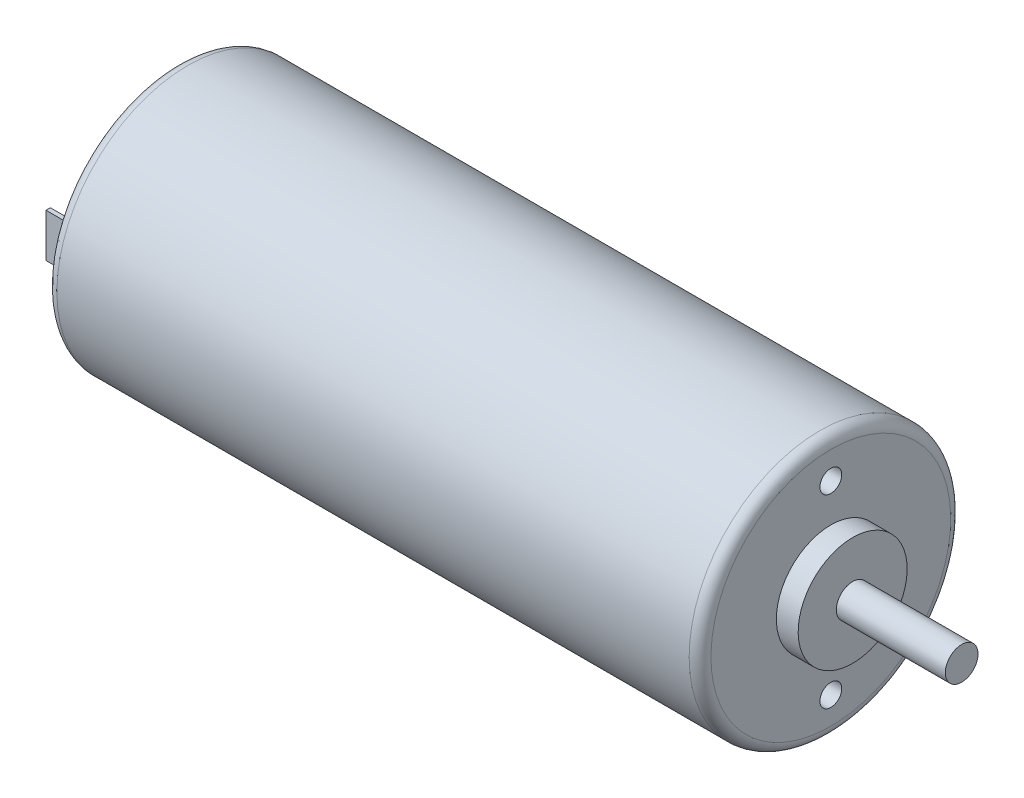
from build123d import *

# Parameters (mm, degrees)
CONG_1_R                = 0.5
ESQUISSE2_W             = 0.2
ESQUISSE2_H             = 2
EXTRUSION1_DEPTH        = 2
ESQUISSE3_R             = 0.5
ENL_V_MAT_EXTRU_1_DEPTH = 2


with BuildPart() as part:
    # Esquisse1 → R_volution1 (revolve)
    with BuildSketch(Plane.XY):
        Polygon((-16, 0), (-16, 2.5), (-15, 2.5), (-15, 6), (15, 6), (15, 2.5), (16, 2.5), (16, 0.75), (21, 0.75), (21, 0), align=None)
    revolve(axis=Axis((52.468834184, 0, 0), (-1, 0, 0)))

    # Cong_1
    cong_1_edges = [part.edges().sort_by_distance(p)[0] for p in [
        (15, -6, 0),
        (-15, -6, 0),
        (-16, -2.5, 0),
    ]]
    fillet(cong_1_edges, radius=CONG_1_R)

    # Esquisse2 → Extrusion1 (add)
    with BuildSketch(Plane.ZY.offset(15)):
        with Locations((-3.9, 0)):
            Rectangle(ESQUISSE2_W, ESQUISSE2_H)
        with Locations((3.9, 0)):
            Rectangle(ESQUISSE2_W, ESQUISSE2_H)
    extrude(amount=EXTRUSION1_DEPTH)

    # Esquisse3 → Enl_v. mat.-Extru.1 (cut)
    with BuildSketch(Plane(origin=(15, 0, 0), x_dir=(0, 0, -1), z_dir=(1, 0, 0))):
        with Locations(Location((0, -4.25, 0), (0, 0, 90))):
            Circle(ESQUISSE3_R)
        with Locations(Location((0, 4.25, 0), (0, 0, 90))):
            Circle(ESQUISSE3_R)
    extrude(amount=-ENL_V_MAT_EXTRU_1_DEPTH, mode=Mode.SUBTRACT)


solid = part.part
